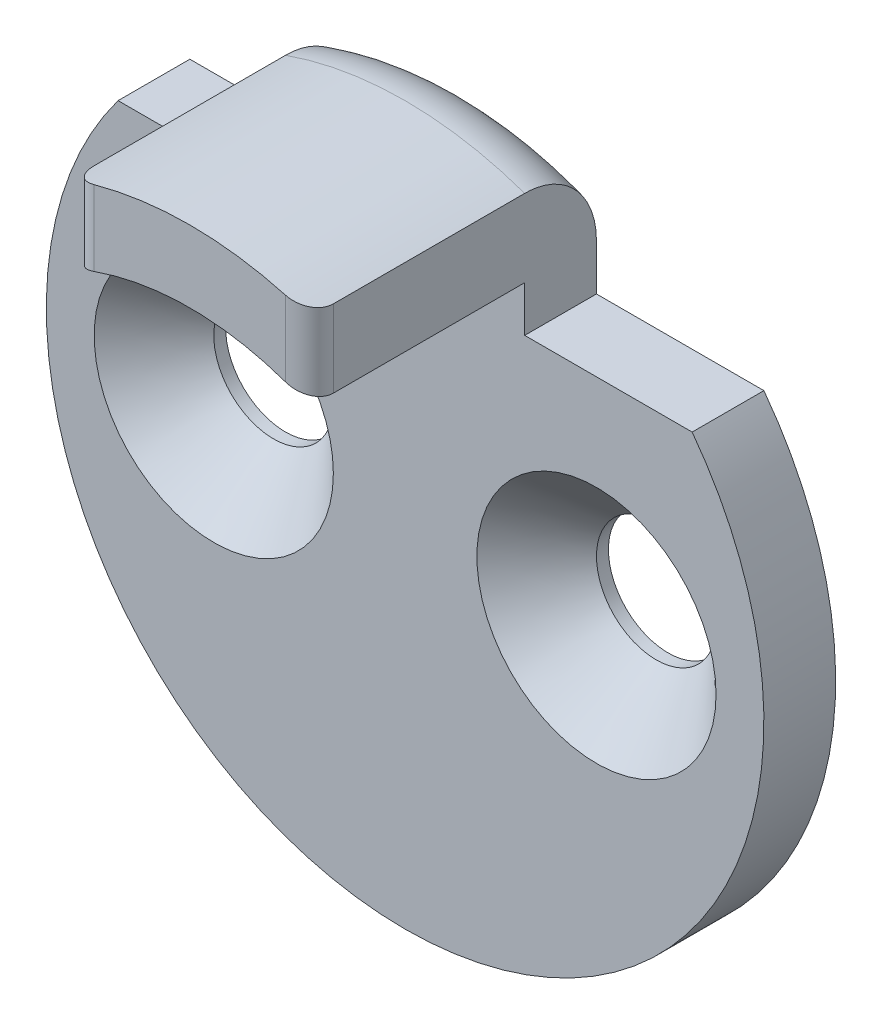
from build123d import *

# Parameters (mm, degrees)
ESQUISSE1_R        = 1.25
BOSS_EXTRU_1_DEPTH = 1.5
BOSS_EXTRU_2_DEPTH = 4.5
CONG_1_R           = 1.5
CONG_2_R           = 0.5
CHANFREIN1_SIZE    = 1.25


with BuildPart() as part:
    # Esquisse1 → Boss.-Extru.1 (new body)
    with BuildSketch(Plane.XY):
        with BuildLine():
            Line((-2.5, 4.5), (-6, 4.5))
            ThreePointArc((-6, 4.5), (0, -7.5), (6, 4.5))
            Line((6, 4.5), (2.5, 4.5))
            Line((2.5, 4.5), (2.5, 7.071067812))
            ThreePointArc((2.5, 7.071067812), (0, 7.5), (-2.5, 7.071067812))
            Line((-2.5, 7.071067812), (-2.5, 4.5))
        make_face()
        with Locations((-4, 0)):
            Circle(ESQUISSE1_R, mode=Mode.SUBTRACT)
        with Locations((4, 0)):
            Circle(ESQUISSE1_R, mode=Mode.SUBTRACT)
    extrude(amount=BOSS_EXTRU_1_DEPTH)

    # Esquisse2 → Boss.-Extru.2 (add)
    with BuildSketch(Plane.XY.offset(1.5)):
        with BuildLine():
            Line((-2.5, 7.071067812), (-2.5, 5.454356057))
            ThreePointArc((-2.5, 5.454356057), (0, 6), (2.5, 5.454356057))
            Line((2.5, 5.454356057), (2.5, 7.071067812))
            ThreePointArc((2.5, 7.071067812), (0, 7.5), (-2.5, 7.071067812))
        make_face()
    extrude(amount=BOSS_EXTRU_2_DEPTH)

    # Cong_1
    cong_1_edges = [part.edges().sort_by_distance(p)[0] for p in [
        (0, 7.5, 0),
    ]]
    fillet(cong_1_edges, radius=CONG_1_R)

    # Cong_2
    cong_2_edges = [part.edges().sort_by_distance(p)[0] for p in [
        (2.5, 6.262711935, 6),
        (-2.5, 6.262711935, 6),
    ]]
    fillet(cong_2_edges, radius=CONG_2_R)

    # Chanfrein1
    chanfrein1_edges = [part.edges().sort_by_distance(p)[0] for p in [
        (-5.25, 0, 1.5),
        (2.75, 0, 1.5),
    ]]
    chamfer(chanfrein1_edges, length=CHANFREIN1_SIZE)


solid = part.part
